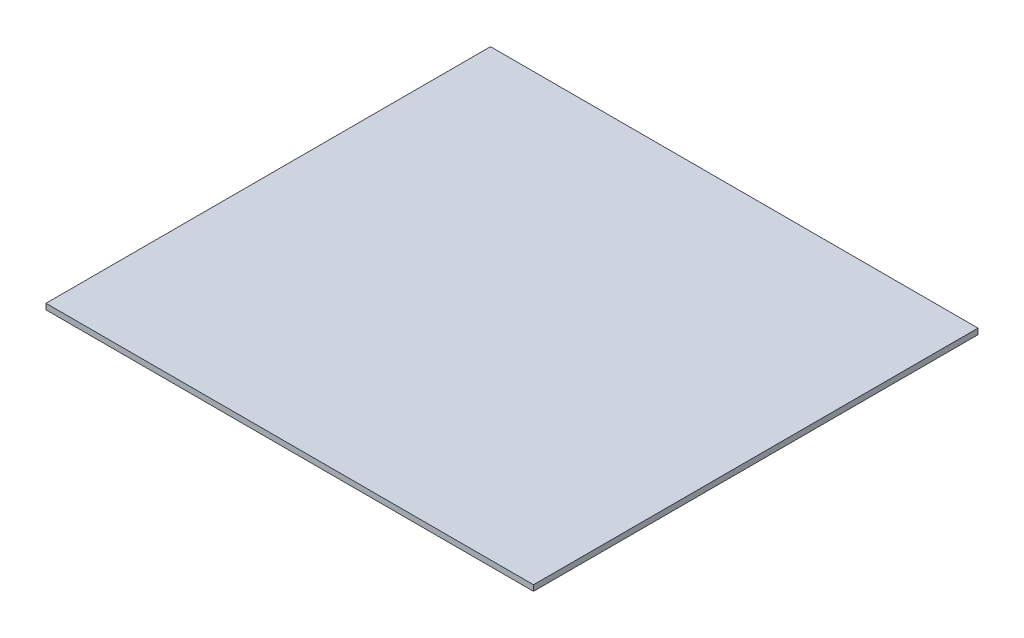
from build123d import *

# Parameters (mm, degrees)
SKETCH2_W           = 216.14420896
SKETCH2_H           = 197.079005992
BOSS_EXTRUDE2_DEPTH = 2.54


with BuildPart() as part:
    # Sketch2 → Boss-Extrude2 (new body)
    with BuildSketch(Plane(origin=(0, 0, 0), x_dir=(1, 0, 0), z_dir=(0, 1, 0))):
        Rectangle(SKETCH2_W, SKETCH2_H)
    extrude(amount=BOSS_EXTRUDE2_DEPTH)


solid = part.part
